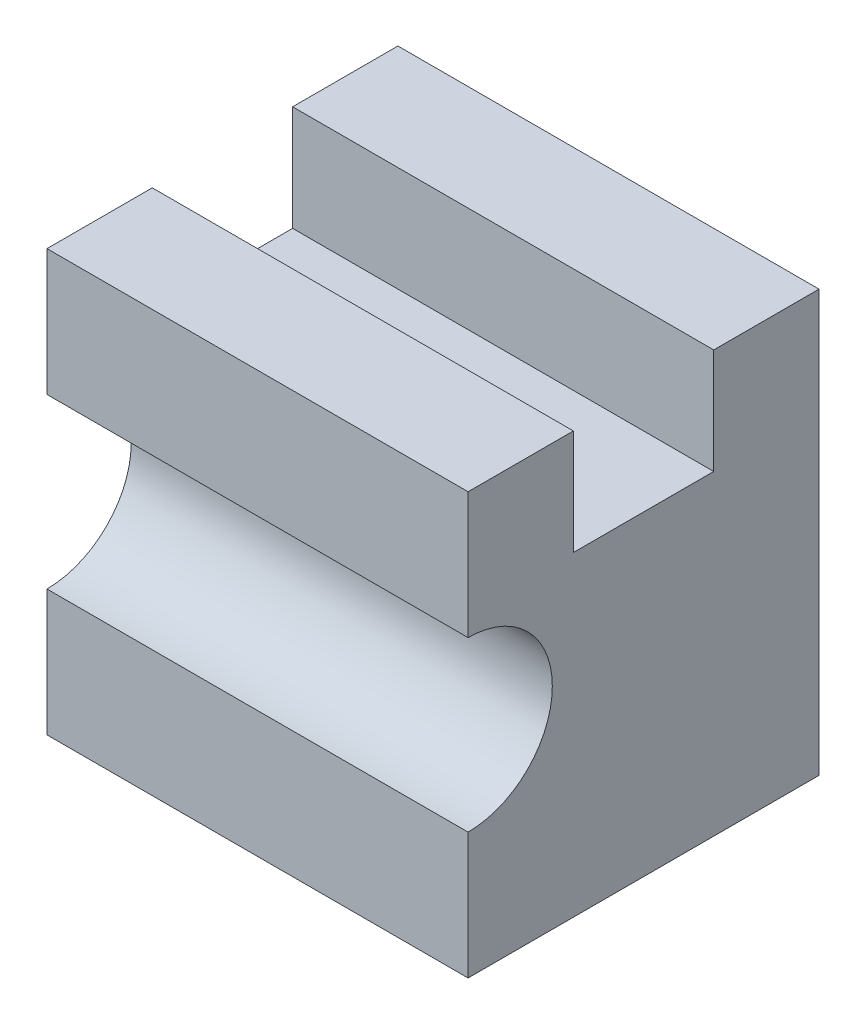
from build123d import *

# Parameters (mm, degrees)
EXTRUDE1_DEPTH = 30


with BuildPart() as part:
    # Sketch1 → Extrude1 (new, symmetric)
    with BuildSketch(Plane(origin=(0, 0, 0), x_dir=(0, 0, -1), z_dir=(1, 0, 0))):
        with BuildLine():
            Line((0, 0), (0, 18))
            ThreePointArc((0, 18), (12, 30), (0, 42))
            Line((0, 42), (0, 60))
            Line((0, 60), (15, 60))
            Line((15, 60), (15, 45))
            Line((15, 45), (35, 45))
            Line((35, 45), (35, 60))
            Line((35, 60), (50, 60))
            Line((50, 60), (50, 0))
            Line((50, 0), (0, 0))
        make_face()
    extrude(amount=EXTRUDE1_DEPTH, both=True)


solid = part.part
